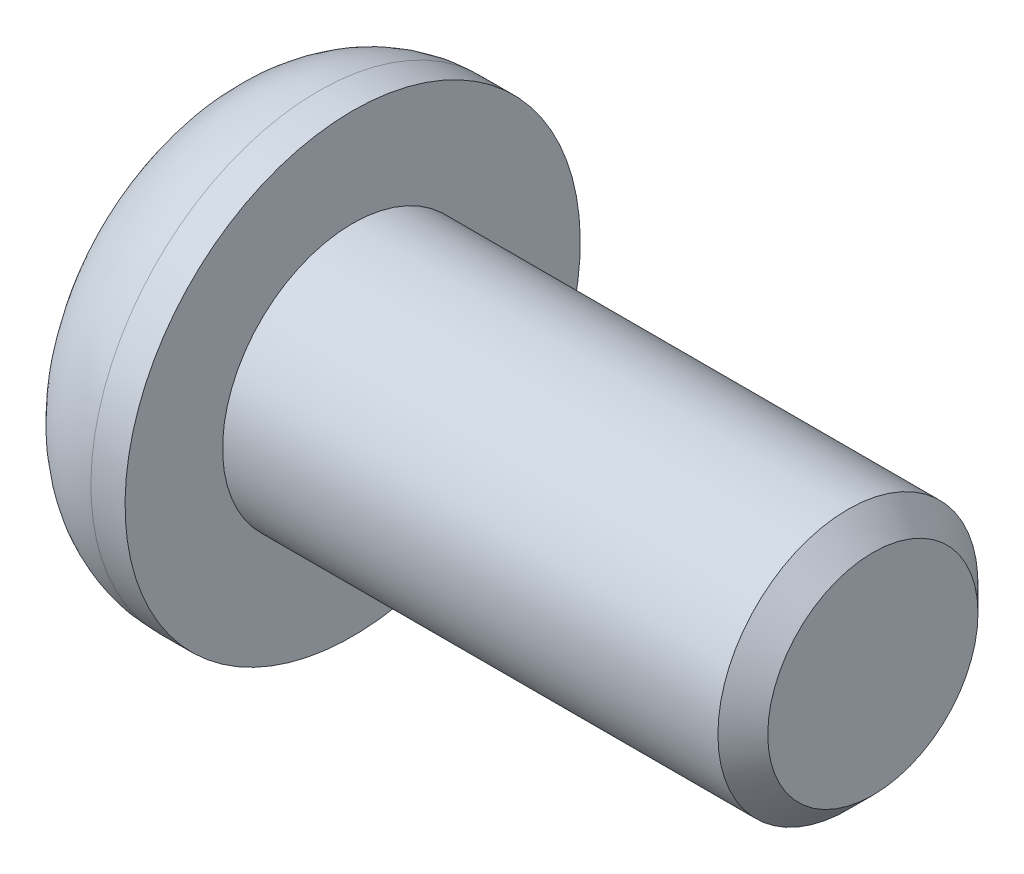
ISO-10303-21;
HEADER;
FILE_DESCRIPTION(('STEP AP214'),'2;1');
FILE_NAME('part.step','',(''),(''),'','','');
FILE_SCHEMA(('AUTOMOTIVE_DESIGN { 1 0 10303 214 1 1 1 1 }'));
ENDSEC;
DATA;
#1=APPLICATION_CONTEXT('core data for automotive mechanical design processes');
#2=APPLICATION_PROTOCOL_DEFINITION('international standard','automotive_design',2000,#1);
#3=PRODUCT_CONTEXT('',#1,'mechanical');
#4=PRODUCT('Part','Part','',(#3));
#5=PRODUCT_RELATED_PRODUCT_CATEGORY('part','',(#4));
#6=PRODUCT_DEFINITION_FORMATION('','',#4);
#7=PRODUCT_DEFINITION_CONTEXT('part definition',#1,'design');
#8=PRODUCT_DEFINITION('design','',#6,#7);
#9=PRODUCT_DEFINITION_SHAPE('','',#8);
#10=(LENGTH_UNIT() NAMED_UNIT(*) SI_UNIT(.MILLI.,.METRE.));
#11=(NAMED_UNIT(*) PLANE_ANGLE_UNIT() SI_UNIT($,.RADIAN.));
#12=(NAMED_UNIT(*) SI_UNIT($,.STERADIAN.) SOLID_ANGLE_UNIT());
#13=UNCERTAINTY_MEASURE_WITH_UNIT(LENGTH_MEASURE(1.E-05),#10,'distance_accuracy_value','');
#14=(GEOMETRIC_REPRESENTATION_CONTEXT(3) GLOBAL_UNCERTAINTY_ASSIGNED_CONTEXT((#13)) GLOBAL_UNIT_ASSIGNED_CONTEXT((#10,
#11,#12)) REPRESENTATION_CONTEXT('',''));
#15=CARTESIAN_POINT('',(0.,0.,0.));
#16=DIRECTION('',(0.,0.,1.));
#17=DIRECTION('',(1.,0.,0.));
#18=AXIS2_PLACEMENT_3D('',#15,#16,#17);
#19=CARTESIAN_POINT('',(-1.81000000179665,0.,0.));
#20=DIRECTION('',(-1.,0.,0.));
#21=DIRECTION('',(0.,0.,1.));
#22=AXIS2_PLACEMENT_3D('',#19,#20,#21);
#23=CONICAL_SURFACE('',#22,2.90407185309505,1.04719754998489);
#24=CARTESIAN_POINT('',(-0.133333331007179,-5.6843418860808E-11,0.));
#25=VERTEX_POINT('',#24);
#26=VERTEX_LOOP('',#25);
#27=FACE_BOUND('',#26,.T.);
#28=CARTESIAN_POINT('',(-1.80000000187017,2.50000000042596,1.44337567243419));
#29=CARTESIAN_POINT('',(-1.76336943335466,2.50000000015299,1.31652043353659));
#30=CARTESIAN_POINT('',(-1.73005584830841,2.500000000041,1.1885701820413));
#31=CARTESIAN_POINT('',(-1.67190798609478,2.4999999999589,0.93045430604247));
#32=CARTESIAN_POINT('',(-1.64709427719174,2.49999999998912,0.800284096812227));
#33=CARTESIAN_POINT('',(-1.60846995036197,2.50000000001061,0.541556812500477));
#34=CARTESIAN_POINT('',(-1.59440223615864,2.50000000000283,0.413039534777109));
#35=CARTESIAN_POINT('',(-1.57761146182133,2.49999999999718,0.155400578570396));
#36=CARTESIAN_POINT('',(-1.57487449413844,2.49999999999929,0.0262798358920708));
#37=CARTESIAN_POINT('',(-1.58058286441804,2.50000000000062,-0.214968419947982));
#38=CARTESIAN_POINT('',(-1.58762660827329,2.50000000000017,-0.327132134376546));
#39=CARTESIAN_POINT('',(-1.60994662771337,2.49999999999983,-0.55072885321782));
#40=CARTESIAN_POINT('',(-1.6252305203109,2.49999999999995,-0.662161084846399));
#41=CARTESIAN_POINT('',(-1.66343729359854,2.50000000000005,-0.886218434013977));
#42=CARTESIAN_POINT('',(-1.68652205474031,2.50000000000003,-0.998815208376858));
#43=CARTESIAN_POINT('',(-1.73891470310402,2.49999999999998,-1.2223298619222));
#44=CARTESIAN_POINT('',(-1.76821028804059,2.49999999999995,-1.33325060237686));
#45=CARTESIAN_POINT('',(-1.80000000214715,2.5,-1.44337567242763));
#46=B_SPLINE_CURVE_WITH_KNOTS('',3,(#28,#29,#30,#31,#32,#33,#34,#35,#36,#37,#38,#39,#40,#41,#42,
#43,#44,#45),.UNSPECIFIED.,.F.,.F.,(4,2,2,2,2,2,2,2,4),(0.,0.396270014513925,0.793492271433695,
1.18088450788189,1.56780111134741,1.90463472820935,2.2417802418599,2.58640202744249,
2.93034746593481),.UNSPECIFIED.);
#47=CARTESIAN_POINT('',(-1.80000000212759,2.49999999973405,1.44337567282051));
#48=VERTEX_POINT('',#47);
#49=CARTESIAN_POINT('',(-1.80000000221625,2.5,-1.44337567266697));
#50=VERTEX_POINT('',#49);
#51=EDGE_CURVE('E19',#48,#50,#46,.T.);
#52=ORIENTED_EDGE('',*,*,#51,.T.);
#53=CARTESIAN_POINT('',(-1.80000000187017,2.49999999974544,-1.4433756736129));
#54=CARTESIAN_POINT('',(-1.76336943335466,2.39014014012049,-1.50680329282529));
#55=CARTESIAN_POINT('',(-1.73005584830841,2.27933197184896,-1.57077841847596));
#56=CARTESIAN_POINT('',(-1.67190798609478,2.05579706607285,-1.69983635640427));
#57=CARTESIAN_POINT('',(-1.64709427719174,1.94306635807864,-1.76492146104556));
#58=CARTESIAN_POINT('',(-1.60846995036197,1.71900195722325,-1.89428510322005));
#59=CARTESIAN_POINT('',(-1.59440223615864,1.6077027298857,-1.95854374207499));
#60=CARTESIAN_POINT('',(-1.57761146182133,1.38458084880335,-2.08736322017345));
#61=CARTESIAN_POINT('',(-1.57487449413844,1.27275900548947,-2.15192359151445));
#62=CARTESIAN_POINT('',(-1.58058286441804,1.06383188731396,-2.27254771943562));
#63=CARTESIAN_POINT('',(-1.58762660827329,0.966695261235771,-2.32862957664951));
#64=CARTESIAN_POINT('',(-1.60994662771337,0.773054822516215,-2.44042793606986));
#65=CARTESIAN_POINT('',(-1.6252305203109,0.676551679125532,-2.49614405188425));
#66=CARTESIAN_POINT('',(-1.66343729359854,0.482512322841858,-2.60817272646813));
#67=CARTESIAN_POINT('',(-1.6865220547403,0.385000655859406,-2.66447111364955));
#68=CARTESIAN_POINT('',(-1.73891470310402,0.191431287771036,-2.77622844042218));
#69=CARTESIAN_POINT('',(-1.76821028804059,0.0953711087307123,-2.83168881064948));
#70=CARTESIAN_POINT('',(-1.80000000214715,4.73226468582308E-10,-2.88675134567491));
#71=B_SPLINE_CURVE_WITH_KNOTS('',3,(#53,#54,#55,#56,#57,#58,#59,#60,#61,#62,#63,#64,#65,#66,#67,
#68,#69,#70),.UNSPECIFIED.,.F.,.F.,(4,2,2,2,2,2,2,2,4),(0.,0.396270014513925,0.793492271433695,
1.18088450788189,1.56780111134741,1.90463472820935,2.2417802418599,2.58640202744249,
2.93034746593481),.UNSPECIFIED.);
#72=CARTESIAN_POINT('',(-1.8000000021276,0.,-2.88675134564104));
#73=VERTEX_POINT('',#72);
#74=EDGE_CURVE('E79',#50,#73,#71,.T.);
#75=ORIENTED_EDGE('',*,*,#74,.T.);
#76=CARTESIAN_POINT('',(-1.80000000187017,-6.805254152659E-10,-2.88675134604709));
#77=CARTESIAN_POINT('',(-1.76336943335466,-0.109859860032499,-2.82332372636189));
#78=CARTESIAN_POINT('',(-1.73005584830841,-0.220668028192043,-2.75934860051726));
#79=CARTESIAN_POINT('',(-1.67190798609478,-0.444202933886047,-2.63029066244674));
#80=CARTESIAN_POINT('',(-1.64709427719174,-0.556933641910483,-2.56520555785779));
#81=CARTESIAN_POINT('',(-1.60846995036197,-0.780998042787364,-2.43584191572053));
#82=CARTESIAN_POINT('',(-1.59440223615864,-0.89229727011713,-2.3715832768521));
#83=CARTESIAN_POINT('',(-1.57761146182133,-1.11541915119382,-2.24276379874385));
#84=CARTESIAN_POINT('',(-1.57487449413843,-1.22724099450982,-2.17820342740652));
#85=CARTESIAN_POINT('',(-1.58058286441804,-1.43616811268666,-2.05757929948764));
#86=CARTESIAN_POINT('',(-1.58762660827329,-1.53330473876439,-2.00149744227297));
#87=CARTESIAN_POINT('',(-1.60994662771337,-1.72694517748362,-1.88969908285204));
#88=CARTESIAN_POINT('',(-1.6252305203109,-1.82344832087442,-1.83398296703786));
#89=CARTESIAN_POINT('',(-1.66343729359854,-2.01748767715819,-1.72195429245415));
#90=CARTESIAN_POINT('',(-1.6865220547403,-2.11499934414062,-1.66565590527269));
#91=CARTESIAN_POINT('',(-1.73891470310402,-2.30856871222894,-1.55389857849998));
#92=CARTESIAN_POINT('',(-1.76821028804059,-2.40462889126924,-1.49843820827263));
#93=CARTESIAN_POINT('',(-1.80000000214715,-2.49999999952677,-1.44337567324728));
#94=B_SPLINE_CURVE_WITH_KNOTS('',3,(#76,#77,#78,#79,#80,#81,#82,#83,#84,#85,#86,#87,#88,#89,#90,
#91,#92,#93),.UNSPECIFIED.,.F.,.F.,(4,2,2,2,2,2,2,2,4),(0.,0.396270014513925,0.793492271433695,
1.18088450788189,1.56780111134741,1.90463472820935,2.2417802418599,2.58640202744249,
2.93034746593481),.UNSPECIFIED.);
#95=CARTESIAN_POINT('',(-1.8000000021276,-2.49999999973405,-1.44337567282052));
#96=VERTEX_POINT('',#95);
#97=EDGE_CURVE('E104',#73,#96,#94,.T.);
#98=ORIENTED_EDGE('',*,*,#97,.T.);
#99=CARTESIAN_POINT('',(-1.80000000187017,-2.50000000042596,-1.44337567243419));
#100=CARTESIAN_POINT('',(-1.76336943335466,-2.50000000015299,-1.3165204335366));
#101=CARTESIAN_POINT('',(-1.73005584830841,-2.500000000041,-1.1885701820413));
#102=CARTESIAN_POINT('',(-1.67190798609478,-2.4999999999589,-0.930454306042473));
#103=CARTESIAN_POINT('',(-1.64709427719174,-2.49999999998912,-0.80028409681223));
#104=CARTESIAN_POINT('',(-1.60846995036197,-2.50000000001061,-0.541556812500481));
#105=CARTESIAN_POINT('',(-1.59440223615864,-2.50000000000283,-0.413039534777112));
#106=CARTESIAN_POINT('',(-1.57761146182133,-2.49999999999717,-0.1554005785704));
#107=CARTESIAN_POINT('',(-1.57487449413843,-2.49999999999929,-0.0262798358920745));
#108=CARTESIAN_POINT('',(-1.58058286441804,-2.50000000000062,0.214968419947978));
#109=CARTESIAN_POINT('',(-1.58762660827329,-2.50000000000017,0.327132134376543));
#110=CARTESIAN_POINT('',(-1.60994662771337,-2.49999999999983,0.550728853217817));
#111=CARTESIAN_POINT('',(-1.6252305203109,-2.49999999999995,0.662161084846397));
#112=CARTESIAN_POINT('',(-1.66343729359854,-2.50000000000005,0.886218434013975));
#113=CARTESIAN_POINT('',(-1.6865220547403,-2.50000000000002,0.998815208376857));
#114=CARTESIAN_POINT('',(-1.73891470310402,-2.49999999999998,1.2223298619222));
#115=CARTESIAN_POINT('',(-1.76821028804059,-2.49999999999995,1.33325060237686));
#116=CARTESIAN_POINT('',(-1.80000000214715,-2.5,1.44337567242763));
#117=B_SPLINE_CURVE_WITH_KNOTS('',3,(#99,#100,#101,#102,#103,#104,#105,#106,#107,#108,#109,#110,
#111,#112,#113,#114,#115,#116),.UNSPECIFIED.,.F.,.F.,(4,2,2,2,2,2,2,2,4),(0.,0.396270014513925,
0.793492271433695,1.18088450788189,1.56780111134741,1.90463472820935,2.2417802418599,
2.58640202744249,2.93034746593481),.UNSPECIFIED.);
#118=CARTESIAN_POINT('',(-1.8000000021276,-2.49999999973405,1.44337567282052));
#119=VERTEX_POINT('',#118);
#120=EDGE_CURVE('E128',#96,#119,#117,.T.);
#121=ORIENTED_EDGE('',*,*,#120,.T.);
#122=CARTESIAN_POINT('',(-1.80000000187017,-2.49999999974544,1.4433756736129));
#123=CARTESIAN_POINT('',(-1.76336943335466,-2.39014014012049,1.50680329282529));
#124=CARTESIAN_POINT('',(-1.73005584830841,-2.27933197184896,1.57077841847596));
#125=CARTESIAN_POINT('',(-1.67190798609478,-2.05579706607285,1.69983635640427));
#126=CARTESIAN_POINT('',(-1.64709427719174,-1.94306635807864,1.76492146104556));
#127=CARTESIAN_POINT('',(-1.60846995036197,-1.71900195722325,1.89428510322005));
#128=CARTESIAN_POINT('',(-1.59440223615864,-1.6077027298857,1.95854374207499));
#129=CARTESIAN_POINT('',(-1.57761146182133,-1.38458084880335,2.08736322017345));
#130=CARTESIAN_POINT('',(-1.57487449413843,-1.27275900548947,2.15192359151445));
#131=CARTESIAN_POINT('',(-1.58058286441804,-1.06383188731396,2.27254771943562));
#132=CARTESIAN_POINT('',(-1.58762660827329,-0.966695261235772,2.32862957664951));
#133=CARTESIAN_POINT('',(-1.60994662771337,-0.773054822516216,2.44042793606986));
#134=CARTESIAN_POINT('',(-1.6252305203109,-0.676551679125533,2.49614405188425));
#135=CARTESIAN_POINT('',(-1.66343729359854,-0.482512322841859,2.60817272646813));
#136=CARTESIAN_POINT('',(-1.6865220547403,-0.385000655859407,2.66447111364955));
#137=CARTESIAN_POINT('',(-1.73891470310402,-0.191431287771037,2.77622844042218));
#138=CARTESIAN_POINT('',(-1.76821028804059,-0.0953711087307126,2.83168881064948));
#139=CARTESIAN_POINT('',(-1.80000000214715,-4.73226897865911E-10,2.88675134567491));
#140=B_SPLINE_CURVE_WITH_KNOTS('',3,(#122,#123,#124,#125,#126,#127,#128,#129,#130,#131,#132,
#133,#134,#135,#136,#137,#138,#139),.UNSPECIFIED.,.F.,.F.,(4,2,2,2,2,2,2,2,4),(0.,
0.396270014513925,0.793492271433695,1.18088450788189,1.56780111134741,1.90463472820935,
2.2417802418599,2.58640202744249,2.93034746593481),.UNSPECIFIED.);
#141=CARTESIAN_POINT('',(-1.8000000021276,0.,2.88675134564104));
#142=VERTEX_POINT('',#141);
#143=EDGE_CURVE('E136',#119,#142,#140,.T.);
#144=ORIENTED_EDGE('',*,*,#143,.T.);
#145=CARTESIAN_POINT('',(-1.80000000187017,6.80524550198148E-10,2.88675134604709));
#146=CARTESIAN_POINT('',(-1.76336943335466,0.109859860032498,2.82332372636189));
#147=CARTESIAN_POINT('',(-1.73005584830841,0.220668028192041,2.75934860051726));
#148=CARTESIAN_POINT('',(-1.67190798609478,0.444202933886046,2.63029066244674));
#149=CARTESIAN_POINT('',(-1.64709427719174,0.556933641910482,2.56520555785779));
#150=CARTESIAN_POINT('',(-1.60846995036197,0.780998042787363,2.43584191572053));
#151=CARTESIAN_POINT('',(-1.59440223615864,0.892297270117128,2.3715832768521));
#152=CARTESIAN_POINT('',(-1.57761146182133,1.11541915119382,2.24276379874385));
#153=CARTESIAN_POINT('',(-1.57487449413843,1.22724099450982,2.17820342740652));
#154=CARTESIAN_POINT('',(-1.58058286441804,1.43616811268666,2.05757929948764));
#155=CARTESIAN_POINT('',(-1.58762660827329,1.53330473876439,2.00149744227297));
#156=CARTESIAN_POINT('',(-1.60994662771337,1.72694517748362,1.88969908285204));
#157=CARTESIAN_POINT('',(-1.6252305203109,1.82344832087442,1.83398296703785));
#158=CARTESIAN_POINT('',(-1.66343729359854,2.01748767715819,1.72195429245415));
#159=CARTESIAN_POINT('',(-1.6865220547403,2.11499934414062,1.66565590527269));
#160=CARTESIAN_POINT('',(-1.73891470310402,2.30856871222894,1.55389857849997));
#161=CARTESIAN_POINT('',(-1.76821028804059,2.40462889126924,1.49843820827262));
#162=CARTESIAN_POINT('',(-1.80000000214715,2.49999999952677,1.44337567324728));
#163=B_SPLINE_CURVE_WITH_KNOTS('',3,(#145,#146,#147,#148,#149,#150,#151,#152,#153,#154,#155,
#156,#157,#158,#159,#160,#161,#162),.UNSPECIFIED.,.F.,.F.,(4,2,2,2,2,2,2,2,4),(0.,
0.396270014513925,0.793492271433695,1.18088450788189,1.56780111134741,1.90463472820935,
2.2417802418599,2.5864020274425,2.93034746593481),.UNSPECIFIED.);
#164=EDGE_CURVE('E81',#142,#48,#163,.T.);
#165=ORIENTED_EDGE('',*,*,#164,.T.);
#166=EDGE_LOOP('',(#52,#75,#98,#121,#144,#165));
#167=FACE_BOUND('',#166,.T.);
#168=ADVANCED_FACE('F15',(#27,#167),#23,.F.);
#169=CARTESIAN_POINT('',(-4.4,2.5,1.44337567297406));
#170=DIRECTION('',(0.,1.,0.));
#171=DIRECTION('',(0.,0.,1.));
#172=AXIS2_PLACEMENT_3D('',#169,#170,#171);
#173=PLANE('',#172);
#174=DIRECTION('',(1.,0.,0.));
#175=VECTOR('',#174,1.);
#176=CARTESIAN_POINT('',(-4.4,2.5,1.44337567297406));
#177=LINE('',#176,#175);
#178=CARTESIAN_POINT('',(-4.4,2.5,1.44337567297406));
#179=VERTEX_POINT('',#178);
#180=EDGE_CURVE('E83',#48,#179,#177,.F.);
#181=ORIENTED_EDGE('',*,*,#180,.T.);
#182=DIRECTION('',(0.,0.,1.));
#183=VECTOR('',#182,1.);
#184=CARTESIAN_POINT('',(-4.4,2.5,0.));
#185=LINE('',#184,#183);
#186=CARTESIAN_POINT('',(-4.4,2.5,-1.44337567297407));
#187=VERTEX_POINT('',#186);
#188=EDGE_CURVE('E88',#187,#179,#185,.T.);
#189=ORIENTED_EDGE('',*,*,#188,.F.);
#190=DIRECTION('',(1.,0.,0.));
#191=VECTOR('',#190,1.);
#192=CARTESIAN_POINT('',(-4.4,2.5,-1.44337567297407));
#193=LINE('',#192,#191);
#194=EDGE_CURVE('E86',#187,#50,#193,.T.);
#195=ORIENTED_EDGE('',*,*,#194,.T.);
#196=ORIENTED_EDGE('',*,*,#51,.F.);
#197=EDGE_LOOP('',(#181,#189,#195,#196));
#198=FACE_BOUND('',#197,.T.);
#199=ADVANCED_FACE('F75',(#198),#173,.F.);
#200=CARTESIAN_POINT('',(-4.4,0.,2.88675134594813));
#201=DIRECTION('',(0.,0.500000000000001,0.866025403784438));
#202=DIRECTION('',(0.,-0.866025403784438,0.500000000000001));
#203=AXIS2_PLACEMENT_3D('',#200,#201,#202);
#204=PLANE('',#203);
#205=DIRECTION('',(1.,0.,0.));
#206=VECTOR('',#205,1.);
#207=CARTESIAN_POINT('',(-4.4,0.,2.88675134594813));
#208=LINE('',#207,#206);
#209=CARTESIAN_POINT('',(-4.4,0.,2.88675134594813));
#210=VERTEX_POINT('',#209);
#211=EDGE_CURVE('E140',#142,#210,#208,.F.);
#212=ORIENTED_EDGE('',*,*,#211,.T.);
#213=DIRECTION('',(0.,-0.866025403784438,0.500000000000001));
#214=VECTOR('',#213,1.);
#215=CARTESIAN_POINT('',(-4.4,2.5,1.44337567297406));
#216=LINE('',#215,#214);
#217=EDGE_CURVE('E94',#179,#210,#216,.T.);
#218=ORIENTED_EDGE('',*,*,#217,.F.);
#219=ORIENTED_EDGE('',*,*,#180,.F.);
#220=ORIENTED_EDGE('',*,*,#164,.F.);
#221=EDGE_LOOP('',(#212,#218,#219,#220));
#222=FACE_BOUND('',#221,.T.);
#223=ADVANCED_FACE('F144',(#222),#204,.F.);
#224=CARTESIAN_POINT('',(-4.4,-2.5,1.44337567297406));
#225=DIRECTION('',(0.,-0.5,0.866025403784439));
#226=DIRECTION('',(0.,-0.866025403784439,-0.5));
#227=AXIS2_PLACEMENT_3D('',#224,#225,#226);
#228=PLANE('',#227);
#229=DIRECTION('',(1.,0.,0.));
#230=VECTOR('',#229,1.);
#231=CARTESIAN_POINT('',(-4.4,-2.5,1.44337567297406));
#232=LINE('',#231,#230);
#233=CARTESIAN_POINT('',(-4.4,-2.5,1.44337567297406));
#234=VERTEX_POINT('',#233);
#235=EDGE_CURVE('E135',#119,#234,#232,.F.);
#236=ORIENTED_EDGE('',*,*,#235,.T.);
#237=DIRECTION('',(0.,-0.866025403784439,-0.5));
#238=VECTOR('',#237,1.);
#239=CARTESIAN_POINT('',(-4.4,0.,2.88675134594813));
#240=LINE('',#239,#238);
#241=EDGE_CURVE('E223',#210,#234,#240,.T.);
#242=ORIENTED_EDGE('',*,*,#241,.F.);
#243=ORIENTED_EDGE('',*,*,#211,.F.);
#244=ORIENTED_EDGE('',*,*,#143,.F.);
#245=EDGE_LOOP('',(#236,#242,#243,#244));
#246=FACE_BOUND('',#245,.T.);
#247=ADVANCED_FACE('F124',(#246),#228,.F.);
#248=CARTESIAN_POINT('',(-4.4,-2.5,-1.44337567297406));
#249=DIRECTION('',(0.,-1.,0.));
#250=DIRECTION('',(0.,0.,-1.));
#251=AXIS2_PLACEMENT_3D('',#248,#249,#250);
#252=PLANE('',#251);
#253=DIRECTION('',(1.,0.,0.));
#254=VECTOR('',#253,1.);
#255=CARTESIAN_POINT('',(-4.4,-2.5,-1.44337567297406));
#256=LINE('',#255,#254);
#257=CARTESIAN_POINT('',(-4.4,-2.5,-1.44337567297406));
#258=VERTEX_POINT('',#257);
#259=EDGE_CURVE('E134',#96,#258,#256,.F.);
#260=ORIENTED_EDGE('',*,*,#259,.T.);
#261=DIRECTION('',(0.,0.,1.));
#262=VECTOR('',#261,1.);
#263=CARTESIAN_POINT('',(-4.4,-2.5,0.));
#264=LINE('',#263,#262);
#265=EDGE_CURVE('E220',#234,#258,#264,.F.);
#266=ORIENTED_EDGE('',*,*,#265,.F.);
#267=ORIENTED_EDGE('',*,*,#235,.F.);
#268=ORIENTED_EDGE('',*,*,#120,.F.);
#269=EDGE_LOOP('',(#260,#266,#267,#268));
#270=FACE_BOUND('',#269,.T.);
#271=ADVANCED_FACE('F120',(#270),#252,.F.);
#272=CARTESIAN_POINT('',(-4.4,0.,-2.88675134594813));
#273=DIRECTION('',(0.,-0.5,-0.866025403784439));
#274=DIRECTION('',(0.,0.866025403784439,-0.5));
#275=AXIS2_PLACEMENT_3D('',#272,#273,#274);
#276=PLANE('',#275);
#277=DIRECTION('',(1.,0.,0.));
#278=VECTOR('',#277,1.);
#279=CARTESIAN_POINT('',(-4.4,0.,-2.88675134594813));
#280=LINE('',#279,#278);
#281=CARTESIAN_POINT('',(-4.4,0.,-2.88675134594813));
#282=VERTEX_POINT('',#281);
#283=EDGE_CURVE('E37',#73,#282,#280,.F.);
#284=ORIENTED_EDGE('',*,*,#283,.T.);
#285=DIRECTION('',(0.,0.866025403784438,-0.500000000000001));
#286=VECTOR('',#285,1.);
#287=CARTESIAN_POINT('',(-4.4,-2.5,-1.44337567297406));
#288=LINE('',#287,#286);
#289=EDGE_CURVE('E217',#258,#282,#288,.T.);
#290=ORIENTED_EDGE('',*,*,#289,.F.);
#291=ORIENTED_EDGE('',*,*,#259,.F.);
#292=ORIENTED_EDGE('',*,*,#97,.F.);
#293=EDGE_LOOP('',(#284,#290,#291,#292));
#294=FACE_BOUND('',#293,.T.);
#295=ADVANCED_FACE('F114',(#294),#276,.F.);
#296=CARTESIAN_POINT('',(-4.4,2.5,-1.44337567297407));
#297=DIRECTION('',(0.,0.5,-0.866025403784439));
#298=DIRECTION('',(0.,0.866025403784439,0.5));
#299=AXIS2_PLACEMENT_3D('',#296,#297,#298);
#300=PLANE('',#299);
#301=ORIENTED_EDGE('',*,*,#194,.F.);
#302=DIRECTION('',(0.,0.866025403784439,0.5));
#303=VECTOR('',#302,1.);
#304=CARTESIAN_POINT('',(-4.4,0.,-2.88675134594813));
#305=LINE('',#304,#303);
#306=EDGE_CURVE('E215',#282,#187,#305,.T.);
#307=ORIENTED_EDGE('',*,*,#306,.F.);
#308=ORIENTED_EDGE('',*,*,#283,.F.);
#309=ORIENTED_EDGE('',*,*,#74,.F.);
#310=EDGE_LOOP('',(#301,#307,#308,#309));
#311=FACE_BOUND('',#310,.T.);
#312=ADVANCED_FACE('F92',(#311),#300,.F.);
#313=CARTESIAN_POINT('',(-4.4,4.94337567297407,0.));
#314=DIRECTION('',(-1.,0.,0.));
#315=DIRECTION('',(0.,0.,1.));
#316=AXIS2_PLACEMENT_3D('',#313,#314,#315);
#317=PLANE('',#316);
#318=ORIENTED_EDGE('',*,*,#289,.T.);
#319=ORIENTED_EDGE('',*,*,#306,.T.);
#320=ORIENTED_EDGE('',*,*,#188,.T.);
#321=ORIENTED_EDGE('',*,*,#217,.T.);
#322=ORIENTED_EDGE('',*,*,#241,.T.);
#323=ORIENTED_EDGE('',*,*,#265,.T.);
#324=EDGE_LOOP('',(#318,#319,#320,#321,#322,#323));
#325=FACE_BOUND('',#324,.T.);
#326=CARTESIAN_POINT('',(-4.4,0.,0.));
#327=DIRECTION('',(1.,0.,0.));
#328=DIRECTION('',(0.,1.,0.));
#329=AXIS2_PLACEMENT_3D('',#326,#327,#328);
#330=CIRCLE('',#329,3.65);
#331=CARTESIAN_POINT('',(-4.4,3.65,0.));
#332=VERTEX_POINT('',#331);
#333=EDGE_CURVE('E192',#332,#332,#330,.T.);
#334=ORIENTED_EDGE('',*,*,#333,.F.);
#335=EDGE_LOOP('',(#334));
#336=FACE_BOUND('',#335,.T.);
#337=ADVANCED_FACE('F113',(#325,#336),#317,.T.);
#338=CARTESIAN_POINT('',(-1.05,0.,0.));
#339=DIRECTION('',(1.,0.,0.));
#340=DIRECTION('',(0.,0.,-1.));
#341=AXIS2_PLACEMENT_3D('',#338,#339,#340);
#342=TOROIDAL_SURFACE('',#341,3.65,3.35);
#343=CARTESIAN_POINT('',(-1.05,0.,0.));
#344=DIRECTION('',(1.,0.,0.));
#345=DIRECTION('',(0.,1.,0.));
#346=AXIS2_PLACEMENT_3D('',#343,#344,#345);
#347=CIRCLE('',#346,7.);
#348=CARTESIAN_POINT('',(-1.05,7.,0.));
#349=VERTEX_POINT('',#348);
#350=EDGE_CURVE('E233',#349,#349,#347,.T.);
#351=ORIENTED_EDGE('',*,*,#350,.F.);
#352=EDGE_LOOP('',(#351));
#353=FACE_BOUND('',#352,.T.);
#354=ORIENTED_EDGE('',*,*,#333,.T.);
#355=EDGE_LOOP('',(#354));
#356=FACE_BOUND('',#355,.T.);
#357=ADVANCED_FACE('F176',(#353,#356),#342,.T.);
#358=CARTESIAN_POINT('',(-2.2,0.,0.));
#359=DIRECTION('',(1.,0.,0.));
#360=DIRECTION('',(0.,1.,0.));
#361=AXIS2_PLACEMENT_3D('',#358,#359,#360);
#362=CYLINDRICAL_SURFACE('',#361,7.);
#363=ORIENTED_EDGE('',*,*,#350,.T.);
#364=EDGE_LOOP('',(#363));
#365=FACE_BOUND('',#364,.T.);
#366=CARTESIAN_POINT('',(0.,0.,0.));
#367=DIRECTION('',(1.,0.,0.));
#368=DIRECTION('',(0.,1.,0.));
#369=AXIS2_PLACEMENT_3D('',#366,#367,#368);
#370=CIRCLE('',#369,7.);
#371=CARTESIAN_POINT('',(0.,7.,0.));
#372=VERTEX_POINT('',#371);
#373=EDGE_CURVE('E102',#372,#372,#370,.T.);
#374=ORIENTED_EDGE('',*,*,#373,.F.);
#375=EDGE_LOOP('',(#374));
#376=FACE_BOUND('',#375,.T.);
#377=ADVANCED_FACE('F173',(#365,#376),#362,.T.);
#378=CARTESIAN_POINT('',(16.,2.,0.));
#379=DIRECTION('',(1.,0.,0.));
#380=DIRECTION('',(0.,0.,-1.));
#381=AXIS2_PLACEMENT_3D('',#378,#379,#380);
#382=PLANE('',#381);
#383=CARTESIAN_POINT('',(16.0000000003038,0.,0.));
#384=DIRECTION('',(-1.,0.,0.));
#385=DIRECTION('',(0.,0.,1.));
#386=AXIS2_PLACEMENT_3D('',#383,#384,#385);
#387=CIRCLE('',#386,3.2331875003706);
#388=CARTESIAN_POINT('',(16.0000000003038,0.,3.2331875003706));
#389=VERTEX_POINT('',#388);
#390=EDGE_CURVE('E229',#389,#389,#387,.T.);
#391=ORIENTED_EDGE('',*,*,#390,.F.);
#392=EDGE_LOOP('',(#391));
#393=FACE_BOUND('',#392,.T.);
#394=ADVANCED_FACE('F169',(#393),#382,.T.);
#395=CARTESIAN_POINT('',(0.,5.5,0.));
#396=DIRECTION('',(1.,0.,0.));
#397=DIRECTION('',(0.,0.,-1.));
#398=AXIS2_PLACEMENT_3D('',#395,#396,#397);
#399=PLANE('',#398);
#400=CARTESIAN_POINT('',(0.,0.,0.));
#401=DIRECTION('',(1.,0.,0.));
#402=DIRECTION('',(0.,1.,0.));
#403=AXIS2_PLACEMENT_3D('',#400,#401,#402);
#404=CIRCLE('',#403,4.);
#405=CARTESIAN_POINT('',(0.,4.,0.));
#406=VERTEX_POINT('',#405);
#407=EDGE_CURVE('E28',#406,#406,#404,.T.);
#408=ORIENTED_EDGE('',*,*,#407,.F.);
#409=EDGE_LOOP('',(#408));
#410=FACE_BOUND('',#409,.T.);
#411=ORIENTED_EDGE('',*,*,#373,.T.);
#412=EDGE_LOOP('',(#411));
#413=FACE_BOUND('',#412,.T.);
#414=ADVANCED_FACE('F162',(#410,#413),#399,.T.);
#415=CARTESIAN_POINT('',(15.2331874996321,0.,0.));
#416=DIRECTION('',(-1.,0.,0.));
#417=DIRECTION('',(0.,0.,1.));
#418=AXIS2_PLACEMENT_3D('',#415,#416,#417);
#419=CONICAL_SURFACE('',#418,3.99999999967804,0.785398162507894);
#420=ORIENTED_EDGE('',*,*,#390,.T.);
#421=EDGE_LOOP('',(#420));
#422=FACE_BOUND('',#421,.T.);
#423=CARTESIAN_POINT('',(15.2331875,0.,0.));
#424=DIRECTION('',(1.,0.,0.));
#425=DIRECTION('',(0.,1.,0.));
#426=AXIS2_PLACEMENT_3D('',#423,#424,#425);
#427=CIRCLE('',#426,4.);
#428=CARTESIAN_POINT('',(15.2331875,4.,0.));
#429=VERTEX_POINT('',#428);
#430=EDGE_CURVE('E10',#429,#429,#427,.F.);
#431=ORIENTED_EDGE('',*,*,#430,.F.);
#432=EDGE_LOOP('',(#431));
#433=FACE_BOUND('',#432,.T.);
#434=ADVANCED_FACE('F155',(#422,#433),#419,.T.);
#435=CARTESIAN_POINT('',(9.25,0.,0.));
#436=DIRECTION('',(1.,0.,0.));
#437=DIRECTION('',(0.,1.,0.));
#438=AXIS2_PLACEMENT_3D('',#435,#436,#437);
#439=CYLINDRICAL_SURFACE('',#438,4.);
#440=ORIENTED_EDGE('',*,*,#430,.T.);
#441=EDGE_LOOP('',(#440));
#442=FACE_BOUND('',#441,.T.);
#443=ORIENTED_EDGE('',*,*,#407,.T.);
#444=EDGE_LOOP('',(#443));
#445=FACE_BOUND('',#444,.T.);
#446=ADVANCED_FACE('F153',(#442,#445),#439,.T.);
#447=CLOSED_SHELL('',(#168,#199,#223,#247,#271,#295,#312,#337,#357,#377,#394,#414,#434,#446));
#448=MANIFOLD_SOLID_BREP('B1',#447);
#449=ADVANCED_BREP_SHAPE_REPRESENTATION('',(#18,#448),#14);
#450=SHAPE_DEFINITION_REPRESENTATION(#9,#449);
ENDSEC;
END-ISO-10303-21;
